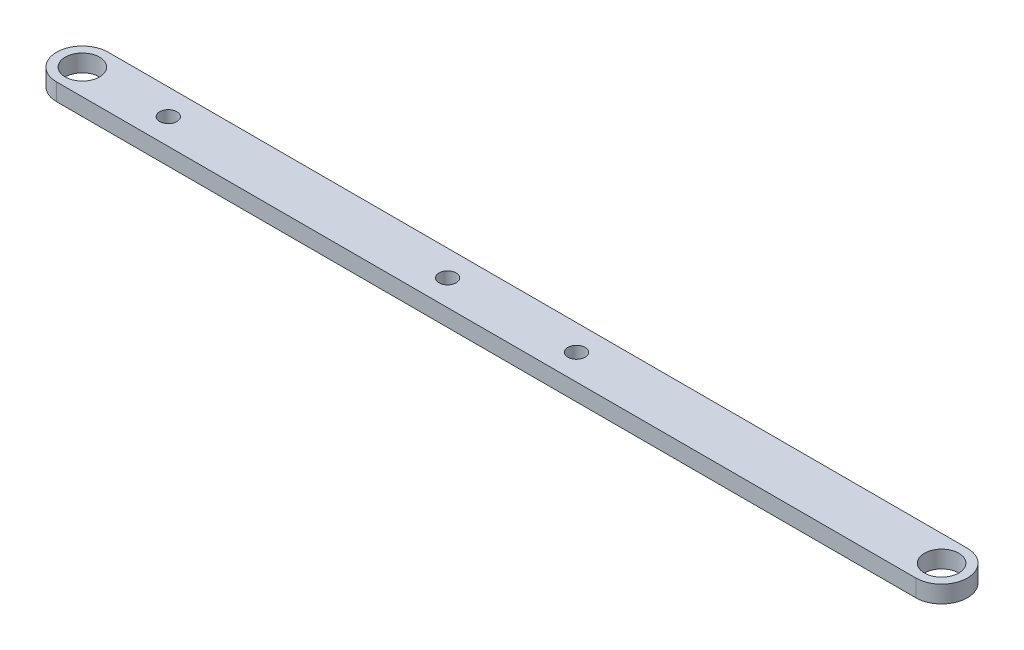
ISO-10303-21;
HEADER;
FILE_DESCRIPTION(('STEP AP214'),'2;1');
FILE_NAME('part.step','',(''),(''),'','','');
FILE_SCHEMA(('AUTOMOTIVE_DESIGN { 1 0 10303 214 1 1 1 1 }'));
ENDSEC;
DATA;
#1=APPLICATION_CONTEXT('core data for automotive mechanical design processes');
#2=APPLICATION_PROTOCOL_DEFINITION('international standard','automotive_design',2000,#1);
#3=PRODUCT_CONTEXT('',#1,'mechanical');
#4=PRODUCT('Part','Part','',(#3));
#5=PRODUCT_RELATED_PRODUCT_CATEGORY('part','',(#4));
#6=PRODUCT_DEFINITION_FORMATION('','',#4);
#7=PRODUCT_DEFINITION_CONTEXT('part definition',#1,'design');
#8=PRODUCT_DEFINITION('design','',#6,#7);
#9=PRODUCT_DEFINITION_SHAPE('','',#8);
#10=(LENGTH_UNIT() NAMED_UNIT(*) SI_UNIT(.MILLI.,.METRE.));
#11=(NAMED_UNIT(*) PLANE_ANGLE_UNIT() SI_UNIT($,.RADIAN.));
#12=(NAMED_UNIT(*) SI_UNIT($,.STERADIAN.) SOLID_ANGLE_UNIT());
#13=UNCERTAINTY_MEASURE_WITH_UNIT(LENGTH_MEASURE(1.E-05),#10,'distance_accuracy_value','');
#14=(GEOMETRIC_REPRESENTATION_CONTEXT(3) GLOBAL_UNCERTAINTY_ASSIGNED_CONTEXT((#13)) GLOBAL_UNIT_ASSIGNED_CONTEXT((#10,
#11,#12)) REPRESENTATION_CONTEXT('',''));
#15=CARTESIAN_POINT('',(0.,0.,0.));
#16=DIRECTION('',(0.,0.,1.));
#17=DIRECTION('',(1.,0.,0.));
#18=AXIS2_PLACEMENT_3D('',#15,#16,#17);
#19=CARTESIAN_POINT('',(-50.,2.,0.));
#20=DIRECTION('',(0.,-1.,0.));
#21=DIRECTION('',(0.,0.,-1.));
#22=AXIS2_PLACEMENT_3D('',#19,#20,#21);
#23=PLANE('',#22);
#24=CARTESIAN_POINT('',(-40.,2.,0.));
#25=DIRECTION('',(0.,1.,0.));
#26=DIRECTION('',(0.,0.,1.));
#27=AXIS2_PLACEMENT_3D('',#24,#25,#26);
#28=CIRCLE('',#27,1.);
#29=CARTESIAN_POINT('',(-40.,2.,1.));
#30=VERTEX_POINT('',#29);
#31=EDGE_CURVE('E118',#30,#30,#28,.T.);
#32=ORIENTED_EDGE('',*,*,#31,.F.);
#33=EDGE_LOOP('',(#32));
#34=FACE_BOUND('',#33,.T.);
#35=CARTESIAN_POINT('',(-7.5,2.,0.));
#36=DIRECTION('',(0.,1.,0.));
#37=DIRECTION('',(0.,0.,1.));
#38=AXIS2_PLACEMENT_3D('',#35,#36,#37);
#39=CIRCLE('',#38,1.);
#40=CARTESIAN_POINT('',(-7.5,2.,1.));
#41=VERTEX_POINT('',#40);
#42=EDGE_CURVE('E103',#41,#41,#39,.T.);
#43=ORIENTED_EDGE('',*,*,#42,.F.);
#44=EDGE_LOOP('',(#43));
#45=FACE_BOUND('',#44,.T.);
#46=CARTESIAN_POINT('',(-50.,2.,0.));
#47=DIRECTION('',(0.,1.,0.));
#48=DIRECTION('',(0.,0.,1.));
#49=AXIS2_PLACEMENT_3D('',#46,#47,#48);
#50=CIRCLE('',#49,2.);
#51=CARTESIAN_POINT('',(-50.,2.,2.));
#52=VERTEX_POINT('',#51);
#53=EDGE_CURVE('E82',#52,#52,#50,.T.);
#54=ORIENTED_EDGE('',*,*,#53,.F.);
#55=EDGE_LOOP('',(#54));
#56=FACE_BOUND('',#55,.T.);
#57=CARTESIAN_POINT('',(-50.,2.,0.));
#58=DIRECTION('',(0.,1.,0.));
#59=DIRECTION('',(0.,0.,-1.));
#60=AXIS2_PLACEMENT_3D('',#57,#58,#59);
#61=CIRCLE('',#60,3.);
#62=CARTESIAN_POINT('',(-50.,2.,-3.));
#63=VERTEX_POINT('',#62);
#64=CARTESIAN_POINT('',(-50.,2.,3.));
#65=VERTEX_POINT('',#64);
#66=EDGE_CURVE('E67',#63,#65,#61,.T.);
#67=ORIENTED_EDGE('',*,*,#66,.T.);
#68=DIRECTION('',(1.,0.,0.));
#69=VECTOR('',#68,1.);
#70=CARTESIAN_POINT('',(-50.,2.,3.));
#71=LINE('',#70,#69);
#72=CARTESIAN_POINT('',(50.,2.,3.));
#73=VERTEX_POINT('',#72);
#74=EDGE_CURVE('E62',#65,#73,#71,.T.);
#75=ORIENTED_EDGE('',*,*,#74,.T.);
#76=CARTESIAN_POINT('',(50.,2.,0.));
#77=DIRECTION('',(0.,1.,0.));
#78=DIRECTION('',(0.,0.,1.));
#79=AXIS2_PLACEMENT_3D('',#76,#77,#78);
#80=CIRCLE('',#79,3.);
#81=CARTESIAN_POINT('',(50.,2.,-3.));
#82=VERTEX_POINT('',#81);
#83=EDGE_CURVE('E65',#73,#82,#80,.T.);
#84=ORIENTED_EDGE('',*,*,#83,.T.);
#85=DIRECTION('',(-1.,0.,0.));
#86=VECTOR('',#85,1.);
#87=CARTESIAN_POINT('',(-50.,2.,-3.));
#88=LINE('',#87,#86);
#89=EDGE_CURVE('E32',#82,#63,#88,.T.);
#90=ORIENTED_EDGE('',*,*,#89,.T.);
#91=EDGE_LOOP('',(#67,#75,#84,#90));
#92=FACE_BOUND('',#91,.T.);
#93=CARTESIAN_POINT('',(50.,2.,0.));
#94=DIRECTION('',(0.,1.,0.));
#95=DIRECTION('',(0.,0.,1.));
#96=AXIS2_PLACEMENT_3D('',#93,#94,#95);
#97=CIRCLE('',#96,2.);
#98=CARTESIAN_POINT('',(50.,2.,1.99999999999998));
#99=VERTEX_POINT('',#98);
#100=EDGE_CURVE('E97',#99,#99,#97,.T.);
#101=ORIENTED_EDGE('',*,*,#100,.F.);
#102=EDGE_LOOP('',(#101));
#103=FACE_BOUND('',#102,.T.);
#104=CARTESIAN_POINT('',(7.5,2.,0.));
#105=DIRECTION('',(0.,1.,0.));
#106=DIRECTION('',(0.,0.,1.));
#107=AXIS2_PLACEMENT_3D('',#104,#105,#106);
#108=CIRCLE('',#107,1.);
#109=CARTESIAN_POINT('',(7.5,2.,0.999999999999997));
#110=VERTEX_POINT('',#109);
#111=EDGE_CURVE('E109',#110,#110,#108,.T.);
#112=ORIENTED_EDGE('',*,*,#111,.F.);
#113=EDGE_LOOP('',(#112));
#114=FACE_BOUND('',#113,.T.);
#115=ADVANCED_FACE('F15',(#34,#45,#56,#92,#103,#114),#23,.F.);
#116=CARTESIAN_POINT('',(-50.,0.,0.));
#117=DIRECTION('',(0.,-1.,0.));
#118=DIRECTION('',(0.,0.,-1.));
#119=AXIS2_PLACEMENT_3D('',#116,#117,#118);
#120=PLANE('',#119);
#121=CARTESIAN_POINT('',(-40.,0.,0.));
#122=DIRECTION('',(0.,1.,0.));
#123=DIRECTION('',(0.,0.,1.));
#124=AXIS2_PLACEMENT_3D('',#121,#122,#123);
#125=CIRCLE('',#124,1.);
#126=CARTESIAN_POINT('',(-40.,0.,1.));
#127=VERTEX_POINT('',#126);
#128=EDGE_CURVE('E115',#127,#127,#125,.T.);
#129=ORIENTED_EDGE('',*,*,#128,.T.);
#130=EDGE_LOOP('',(#129));
#131=FACE_BOUND('',#130,.T.);
#132=CARTESIAN_POINT('',(-7.5,0.,0.));
#133=DIRECTION('',(0.,1.,0.));
#134=DIRECTION('',(0.,0.,1.));
#135=AXIS2_PLACEMENT_3D('',#132,#133,#134);
#136=CIRCLE('',#135,1.);
#137=CARTESIAN_POINT('',(-7.5,0.,1.));
#138=VERTEX_POINT('',#137);
#139=EDGE_CURVE('E106',#138,#138,#136,.T.);
#140=ORIENTED_EDGE('',*,*,#139,.T.);
#141=EDGE_LOOP('',(#140));
#142=FACE_BOUND('',#141,.T.);
#143=CARTESIAN_POINT('',(-50.,0.,0.));
#144=DIRECTION('',(0.,1.,0.));
#145=DIRECTION('',(0.,0.,1.));
#146=AXIS2_PLACEMENT_3D('',#143,#144,#145);
#147=CIRCLE('',#146,2.);
#148=CARTESIAN_POINT('',(-50.,0.,2.));
#149=VERTEX_POINT('',#148);
#150=EDGE_CURVE('E94',#149,#149,#147,.T.);
#151=ORIENTED_EDGE('',*,*,#150,.T.);
#152=EDGE_LOOP('',(#151));
#153=FACE_BOUND('',#152,.T.);
#154=CARTESIAN_POINT('',(-50.,0.,0.));
#155=DIRECTION('',(0.,1.,0.));
#156=DIRECTION('',(0.,0.,-1.));
#157=AXIS2_PLACEMENT_3D('',#154,#155,#156);
#158=CIRCLE('',#157,3.);
#159=CARTESIAN_POINT('',(-50.,0.,-3.));
#160=VERTEX_POINT('',#159);
#161=CARTESIAN_POINT('',(-50.,0.,3.));
#162=VERTEX_POINT('',#161);
#163=EDGE_CURVE('E79',#160,#162,#158,.T.);
#164=ORIENTED_EDGE('',*,*,#163,.F.);
#165=DIRECTION('',(-1.,0.,0.));
#166=VECTOR('',#165,1.);
#167=CARTESIAN_POINT('',(-50.,0.,-3.));
#168=LINE('',#167,#166);
#169=CARTESIAN_POINT('',(50.,0.,-3.));
#170=VERTEX_POINT('',#169);
#171=EDGE_CURVE('E55',#170,#160,#168,.T.);
#172=ORIENTED_EDGE('',*,*,#171,.F.);
#173=CARTESIAN_POINT('',(50.,0.,0.));
#174=DIRECTION('',(0.,1.,0.));
#175=DIRECTION('',(0.,0.,1.));
#176=AXIS2_PLACEMENT_3D('',#173,#174,#175);
#177=CIRCLE('',#176,3.);
#178=CARTESIAN_POINT('',(50.,0.,3.));
#179=VERTEX_POINT('',#178);
#180=EDGE_CURVE('E49',#179,#170,#177,.T.);
#181=ORIENTED_EDGE('',*,*,#180,.F.);
#182=DIRECTION('',(1.,0.,0.));
#183=VECTOR('',#182,1.);
#184=CARTESIAN_POINT('',(-50.,0.,3.));
#185=LINE('',#184,#183);
#186=EDGE_CURVE('E71',#162,#179,#185,.T.);
#187=ORIENTED_EDGE('',*,*,#186,.F.);
#188=EDGE_LOOP('',(#164,#172,#181,#187));
#189=FACE_BOUND('',#188,.T.);
#190=CARTESIAN_POINT('',(50.,0.,0.));
#191=DIRECTION('',(0.,1.,0.));
#192=DIRECTION('',(0.,0.,1.));
#193=AXIS2_PLACEMENT_3D('',#190,#191,#192);
#194=CIRCLE('',#193,2.);
#195=CARTESIAN_POINT('',(50.,0.,1.99999999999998));
#196=VERTEX_POINT('',#195);
#197=EDGE_CURVE('E100',#196,#196,#194,.T.);
#198=ORIENTED_EDGE('',*,*,#197,.T.);
#199=EDGE_LOOP('',(#198));
#200=FACE_BOUND('',#199,.T.);
#201=CARTESIAN_POINT('',(7.5,0.,0.));
#202=DIRECTION('',(0.,1.,0.));
#203=DIRECTION('',(0.,0.,1.));
#204=AXIS2_PLACEMENT_3D('',#201,#202,#203);
#205=CIRCLE('',#204,1.);
#206=CARTESIAN_POINT('',(7.5,0.,0.999999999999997));
#207=VERTEX_POINT('',#206);
#208=EDGE_CURVE('E112',#207,#207,#205,.T.);
#209=ORIENTED_EDGE('',*,*,#208,.T.);
#210=EDGE_LOOP('',(#209));
#211=FACE_BOUND('',#210,.T.);
#212=ADVANCED_FACE('F90',(#131,#142,#153,#189,#200,#211),#120,.T.);
#213=CARTESIAN_POINT('',(-50.,2.,0.));
#214=DIRECTION('',(0.,-1.,0.));
#215=DIRECTION('',(0.,0.,-1.));
#216=AXIS2_PLACEMENT_3D('',#213,#214,#215);
#217=CYLINDRICAL_SURFACE('',#216,3.);
#218=ORIENTED_EDGE('',*,*,#163,.T.);
#219=DIRECTION('',(0.,-1.,0.));
#220=VECTOR('',#219,1.);
#221=CARTESIAN_POINT('',(-50.,2.,3.));
#222=LINE('',#221,#220);
#223=EDGE_CURVE('E9',#65,#162,#222,.T.);
#224=ORIENTED_EDGE('',*,*,#223,.F.);
#225=ORIENTED_EDGE('',*,*,#66,.F.);
#226=DIRECTION('',(0.,-1.,0.));
#227=VECTOR('',#226,1.);
#228=CARTESIAN_POINT('',(-50.,2.,-3.));
#229=LINE('',#228,#227);
#230=EDGE_CURVE('E75',#63,#160,#229,.T.);
#231=ORIENTED_EDGE('',*,*,#230,.T.);
#232=EDGE_LOOP('',(#218,#224,#225,#231));
#233=FACE_BOUND('',#232,.T.);
#234=ADVANCED_FACE('F17',(#233),#217,.T.);
#235=CARTESIAN_POINT('',(-50.,2.,3.));
#236=DIRECTION('',(0.,0.,-1.));
#237=DIRECTION('',(-1.,0.,0.));
#238=AXIS2_PLACEMENT_3D('',#235,#236,#237);
#239=PLANE('',#238);
#240=ORIENTED_EDGE('',*,*,#186,.T.);
#241=DIRECTION('',(0.,-1.,0.));
#242=VECTOR('',#241,1.);
#243=CARTESIAN_POINT('',(50.,2.,3.));
#244=LINE('',#243,#242);
#245=EDGE_CURVE('E24',#73,#179,#244,.T.);
#246=ORIENTED_EDGE('',*,*,#245,.F.);
#247=ORIENTED_EDGE('',*,*,#74,.F.);
#248=ORIENTED_EDGE('',*,*,#223,.T.);
#249=EDGE_LOOP('',(#240,#246,#247,#248));
#250=FACE_BOUND('',#249,.T.);
#251=ADVANCED_FACE('F70',(#250),#239,.F.);
#252=CARTESIAN_POINT('',(50.,2.,0.));
#253=DIRECTION('',(0.,-1.,0.));
#254=DIRECTION('',(0.,0.,-1.));
#255=AXIS2_PLACEMENT_3D('',#252,#253,#254);
#256=CYLINDRICAL_SURFACE('',#255,3.);
#257=ORIENTED_EDGE('',*,*,#180,.T.);
#258=DIRECTION('',(0.,-1.,0.));
#259=VECTOR('',#258,1.);
#260=CARTESIAN_POINT('',(50.,2.,-3.));
#261=LINE('',#260,#259);
#262=EDGE_CURVE('E72',#82,#170,#261,.T.);
#263=ORIENTED_EDGE('',*,*,#262,.F.);
#264=ORIENTED_EDGE('',*,*,#83,.F.);
#265=ORIENTED_EDGE('',*,*,#245,.T.);
#266=EDGE_LOOP('',(#257,#263,#264,#265));
#267=FACE_BOUND('',#266,.T.);
#268=ADVANCED_FACE('F73',(#267),#256,.T.);
#269=CARTESIAN_POINT('',(-50.,2.,-3.));
#270=DIRECTION('',(0.,0.,1.));
#271=DIRECTION('',(1.,0.,0.));
#272=AXIS2_PLACEMENT_3D('',#269,#270,#271);
#273=PLANE('',#272);
#274=ORIENTED_EDGE('',*,*,#171,.T.);
#275=ORIENTED_EDGE('',*,*,#230,.F.);
#276=ORIENTED_EDGE('',*,*,#89,.F.);
#277=ORIENTED_EDGE('',*,*,#262,.T.);
#278=EDGE_LOOP('',(#274,#275,#276,#277));
#279=FACE_BOUND('',#278,.T.);
#280=ADVANCED_FACE('F87',(#279),#273,.F.);
#281=CARTESIAN_POINT('',(-50.,2.,0.));
#282=DIRECTION('',(0.,-1.,0.));
#283=DIRECTION('',(0.,0.,-1.));
#284=AXIS2_PLACEMENT_3D('',#281,#282,#283);
#285=CYLINDRICAL_SURFACE('',#284,2.);
#286=ORIENTED_EDGE('',*,*,#53,.T.);
#287=EDGE_LOOP('',(#286));
#288=FACE_BOUND('',#287,.T.);
#289=ORIENTED_EDGE('',*,*,#150,.F.);
#290=EDGE_LOOP('',(#289));
#291=FACE_BOUND('',#290,.T.);
#292=ADVANCED_FACE('F140',(#288,#291),#285,.F.);
#293=CARTESIAN_POINT('',(50.,2.,0.));
#294=DIRECTION('',(0.,-1.,0.));
#295=DIRECTION('',(0.,0.,-1.));
#296=AXIS2_PLACEMENT_3D('',#293,#294,#295);
#297=CYLINDRICAL_SURFACE('',#296,2.);
#298=ORIENTED_EDGE('',*,*,#100,.T.);
#299=EDGE_LOOP('',(#298));
#300=FACE_BOUND('',#299,.T.);
#301=ORIENTED_EDGE('',*,*,#197,.F.);
#302=EDGE_LOOP('',(#301));
#303=FACE_BOUND('',#302,.T.);
#304=ADVANCED_FACE('F143',(#300,#303),#297,.F.);
#305=CARTESIAN_POINT('',(-7.5,2.,0.));
#306=DIRECTION('',(0.,-1.,0.));
#307=DIRECTION('',(0.,0.,-1.));
#308=AXIS2_PLACEMENT_3D('',#305,#306,#307);
#309=CYLINDRICAL_SURFACE('',#308,1.);
#310=ORIENTED_EDGE('',*,*,#42,.T.);
#311=EDGE_LOOP('',(#310));
#312=FACE_BOUND('',#311,.T.);
#313=ORIENTED_EDGE('',*,*,#139,.F.);
#314=EDGE_LOOP('',(#313));
#315=FACE_BOUND('',#314,.T.);
#316=ADVANCED_FACE('F191',(#312,#315),#309,.F.);
#317=CARTESIAN_POINT('',(7.5,2.,0.));
#318=DIRECTION('',(0.,-1.,0.));
#319=DIRECTION('',(0.,0.,-1.));
#320=AXIS2_PLACEMENT_3D('',#317,#318,#319);
#321=CYLINDRICAL_SURFACE('',#320,1.);
#322=ORIENTED_EDGE('',*,*,#111,.T.);
#323=EDGE_LOOP('',(#322));
#324=FACE_BOUND('',#323,.T.);
#325=ORIENTED_EDGE('',*,*,#208,.F.);
#326=EDGE_LOOP('',(#325));
#327=FACE_BOUND('',#326,.T.);
#328=ADVANCED_FACE('F129',(#324,#327),#321,.F.);
#329=CARTESIAN_POINT('',(-40.,0.,0.));
#330=DIRECTION('',(0.,1.,0.));
#331=DIRECTION('',(0.,0.,1.));
#332=AXIS2_PLACEMENT_3D('',#329,#330,#331);
#333=CYLINDRICAL_SURFACE('',#332,1.);
#334=ORIENTED_EDGE('',*,*,#128,.F.);
#335=EDGE_LOOP('',(#334));
#336=FACE_BOUND('',#335,.T.);
#337=ORIENTED_EDGE('',*,*,#31,.T.);
#338=EDGE_LOOP('',(#337));
#339=FACE_BOUND('',#338,.T.);
#340=ADVANCED_FACE('F126',(#336,#339),#333,.F.);
#341=CLOSED_SHELL('',(#115,#212,#234,#251,#268,#280,#292,#304,#316,#328,#340));
#342=MANIFOLD_SOLID_BREP('B1',#341);
#343=ADVANCED_BREP_SHAPE_REPRESENTATION('',(#18,#342),#14);
#344=SHAPE_DEFINITION_REPRESENTATION(#9,#343);
ENDSEC;
END-ISO-10303-21;
